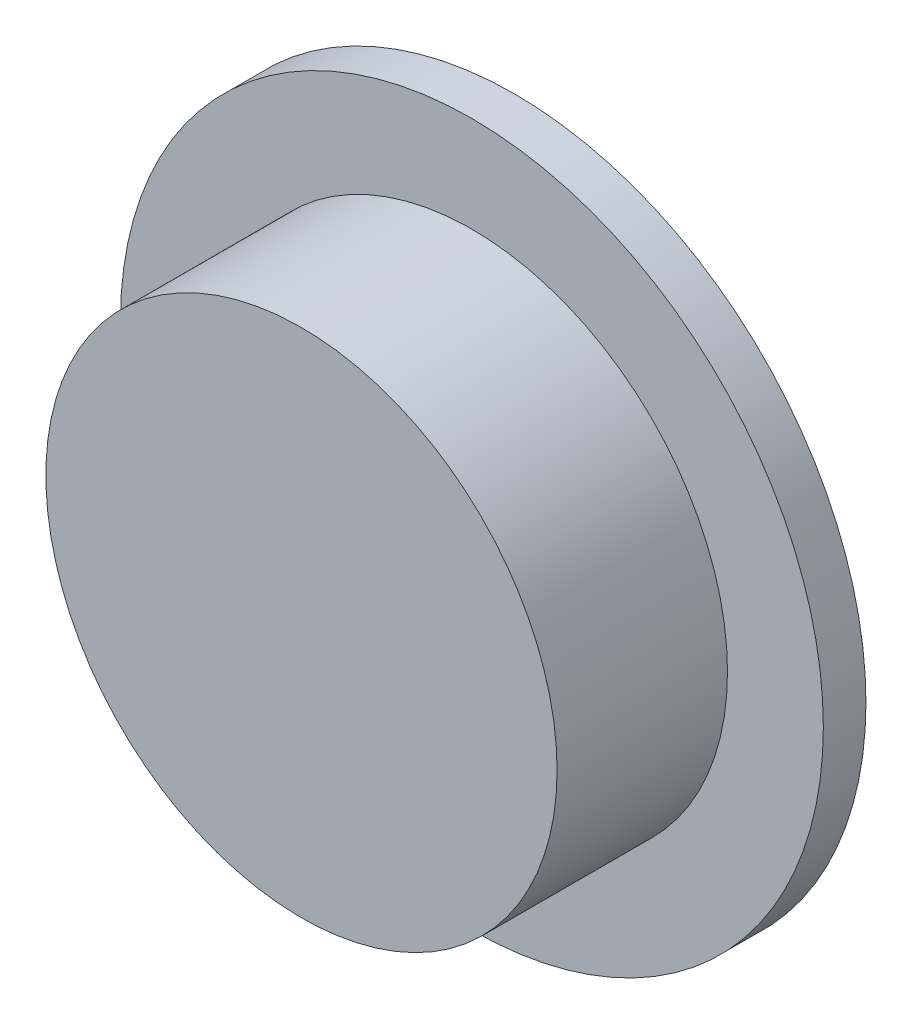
from build123d import *

# Parameters (mm, degrees)
SKETCH2_R                = 16.5
BOSS_EXTRUDE1_DEPTH      = 2
BOSS_EXTRUDE2_DEPTH      = 8
BOSS_EXTRUDE2_DEPTH_BACK = 4
SKETCH3_R                = 12
HOLE1_D                  = 12
HOLE1_DEPTH              = 6.999885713
HOLE1_CBORE_D            = 16
HOLE1_CBORE_DEPTH        = 1


with BuildPart() as part:
    # Sketch2 → Boss-Extrude1 (new body)
    with BuildSketch(Plane.XY):
        Circle(SKETCH2_R)
    extrude(amount=BOSS_EXTRUDE1_DEPTH)

    # Sketch3 → Boss-Extrude2 (add, two sides: drawn at the far end of the back side and taken through both)
    with BuildSketch(Plane.XY.offset(2).offset(-BOSS_EXTRUDE2_DEPTH_BACK)):
        Circle(SKETCH3_R)
    extrude(amount=BOSS_EXTRUDE2_DEPTH + BOSS_EXTRUDE2_DEPTH_BACK)

    # Hole1
    with Locations(Plane(origin=(0, 0, -2), x_dir=(-1, 0, 0), z_dir=(0, 0, -1))):
        with Locations((0, 0)):
            CounterBoreHole(HOLE1_D / 2, HOLE1_CBORE_D / 2, HOLE1_CBORE_DEPTH, depth=HOLE1_DEPTH)


solid = part.part
